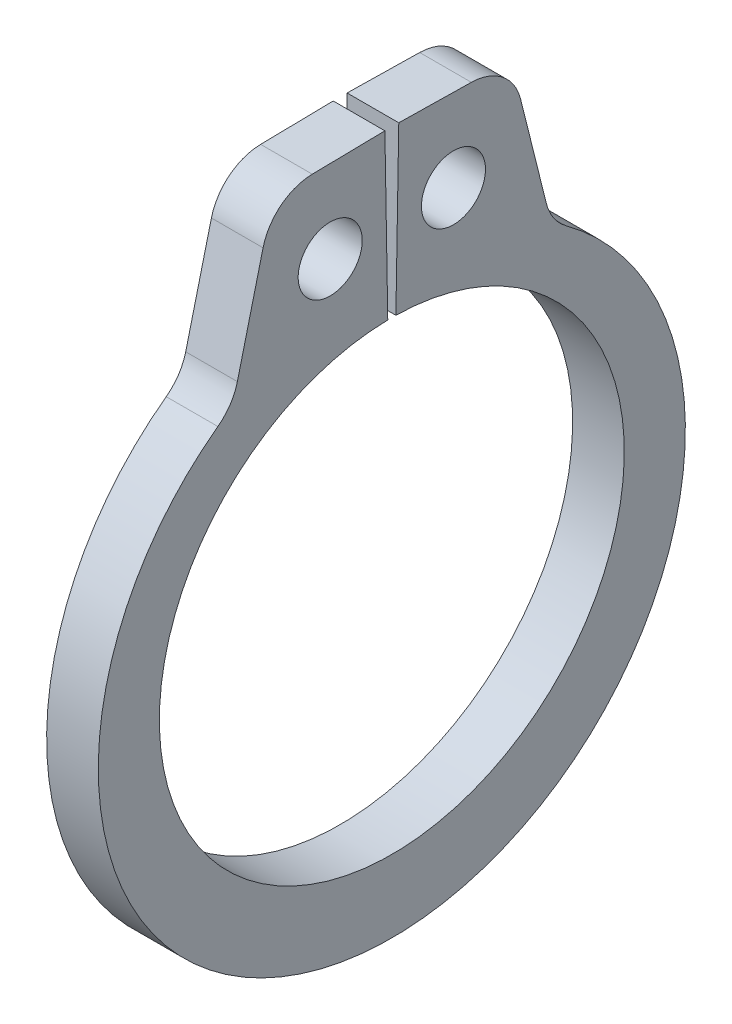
ISO-10303-21;
HEADER;
FILE_DESCRIPTION(('STEP AP214'),'2;1');
FILE_NAME('part.step','',(''),(''),'','','');
FILE_SCHEMA(('AUTOMOTIVE_DESIGN { 1 0 10303 214 1 1 1 1 }'));
ENDSEC;
DATA;
#1=APPLICATION_CONTEXT('core data for automotive mechanical design processes');
#2=APPLICATION_PROTOCOL_DEFINITION('international standard','automotive_design',2000,#1);
#3=PRODUCT_CONTEXT('',#1,'mechanical');
#4=PRODUCT('Part','Part','',(#3));
#5=PRODUCT_RELATED_PRODUCT_CATEGORY('part','',(#4));
#6=PRODUCT_DEFINITION_FORMATION('','',#4);
#7=PRODUCT_DEFINITION_CONTEXT('part definition',#1,'design');
#8=PRODUCT_DEFINITION('design','',#6,#7);
#9=PRODUCT_DEFINITION_SHAPE('','',#8);
#10=(LENGTH_UNIT() NAMED_UNIT(*) SI_UNIT(.MILLI.,.METRE.));
#11=(NAMED_UNIT(*) PLANE_ANGLE_UNIT() SI_UNIT($,.RADIAN.));
#12=(NAMED_UNIT(*) SI_UNIT($,.STERADIAN.) SOLID_ANGLE_UNIT());
#13=UNCERTAINTY_MEASURE_WITH_UNIT(LENGTH_MEASURE(1.E-05),#10,'distance_accuracy_value','');
#14=(GEOMETRIC_REPRESENTATION_CONTEXT(3) GLOBAL_UNCERTAINTY_ASSIGNED_CONTEXT((#13)) GLOBAL_UNIT_ASSIGNED_CONTEXT((#10,
#11,#12)) REPRESENTATION_CONTEXT('',''));
#15=CARTESIAN_POINT('',(0.,0.,0.));
#16=DIRECTION('',(0.,0.,1.));
#17=DIRECTION('',(1.,0.,0.));
#18=AXIS2_PLACEMENT_3D('',#15,#16,#17);
#19=CARTESIAN_POINT('',(0.3175,0.,0.));
#20=DIRECTION('',(1.,0.,0.));
#21=DIRECTION('',(0.,0.,-1.));
#22=AXIS2_PLACEMENT_3D('',#19,#20,#21);
#23=PLANE('',#22);
#24=CARTESIAN_POINT('',(0.3175,3.860869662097,0.757395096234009));
#25=DIRECTION('',(1.,0.,0.));
#26=DIRECTION('',(0.,0.,-1.));
#27=AXIS2_PLACEMENT_3D('',#24,#25,#26);
#28=CIRCLE('',#27,0.3937);
#29=CARTESIAN_POINT('',(0.3175,3.860869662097,0.363695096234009));
#30=VERTEX_POINT('',#29);
#31=EDGE_CURVE('E221',#30,#30,#28,.T.);
#32=ORIENTED_EDGE('',*,*,#31,.F.);
#33=EDGE_LOOP('',(#32));
#34=FACE_BOUND('',#33,.T.);
#35=DIRECTION('',(0.,0.970295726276,0.241921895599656));
#36=VECTOR('',#35,1.);
#37=CARTESIAN_POINT('',(0.3175,4.86467453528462,-1.46491994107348));
#38=LINE('',#37,#36);
#39=CARTESIAN_POINT('',(0.3175,3.12546492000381,-1.89855360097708));
#40=VERTEX_POINT('',#39);
#41=CARTESIAN_POINT('',(0.3175,4.39189538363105,-1.58279702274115));
#42=VERTEX_POINT('',#41);
#43=EDGE_CURVE('E204',#40,#42,#38,.T.);
#44=ORIENTED_EDGE('',*,*,#43,.T.);
#45=CARTESIAN_POINT('',(0.3175,4.23827497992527,-0.966659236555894));
#46=DIRECTION('',(1.,0.,0.));
#47=DIRECTION('',(0.,0.,-1.));
#48=AXIS2_PLACEMENT_3D('',#45,#46,#47);
#49=CIRCLE('',#48,0.635);
#50=CARTESIAN_POINT('',(0.3175,4.87317826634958,-0.977741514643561));
#51=VERTEX_POINT('',#50);
#52=EDGE_CURVE('E172',#42,#51,#49,.T.);
#53=ORIENTED_EDGE('',*,*,#52,.T.);
#54=DIRECTION('',(0.,0.0174524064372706,0.999847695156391));
#55=VECTOR('',#54,1.);
#56=CARTESIAN_POINT('',(0.3175,4.88875530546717,-0.0853335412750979));
#57=LINE('',#56,#55);
#58=CARTESIAN_POINT('',(0.3175,4.88875530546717,-0.0853335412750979));
#59=VERTEX_POINT('',#58);
#60=EDGE_CURVE('E210',#51,#59,#57,.T.);
#61=ORIENTED_EDGE('',*,*,#60,.T.);
#62=DIRECTION('',(0.,-0.999847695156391,0.0174524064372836));
#63=VECTOR('',#62,1.);
#64=CARTESIAN_POINT('',(0.3175,4.88875530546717,-0.0853335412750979));
#65=LINE('',#64,#63);
#66=CARTESIAN_POINT('',(0.3175,2.85706478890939,-0.0498702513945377));
#67=VERTEX_POINT('',#66);
#68=EDGE_CURVE('E144',#59,#67,#65,.T.);
#69=ORIENTED_EDGE('',*,*,#68,.T.);
#70=CARTESIAN_POINT('',(0.3175,0.,0.));
#71=DIRECTION('',(-1.,0.,0.));
#72=DIRECTION('',(0.,0.,-1.));
#73=AXIS2_PLACEMENT_3D('',#70,#71,#72);
#74=CIRCLE('',#73,2.8575);
#75=CARTESIAN_POINT('',(0.3175,2.85706478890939,0.0498702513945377));
#76=VERTEX_POINT('',#75);
#77=EDGE_CURVE('E138',#67,#76,#74,.T.);
#78=ORIENTED_EDGE('',*,*,#77,.T.);
#79=DIRECTION('',(0.,0.999847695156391,0.0174524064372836));
#80=VECTOR('',#79,1.);
#81=CARTESIAN_POINT('',(0.3175,2.85706478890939,0.0498702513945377));
#82=LINE('',#81,#80);
#83=CARTESIAN_POINT('',(0.3175,4.88875530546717,0.0853335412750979));
#84=VERTEX_POINT('',#83);
#85=EDGE_CURVE('E127',#76,#84,#82,.T.);
#86=ORIENTED_EDGE('',*,*,#85,.T.);
#87=DIRECTION('',(0.,-0.0174524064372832,0.999847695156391));
#88=VECTOR('',#87,1.);
#89=CARTESIAN_POINT('',(0.3175,4.88875530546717,0.0853335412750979));
#90=LINE('',#89,#88);
#91=CARTESIAN_POINT('',(0.3175,4.87317826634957,0.977741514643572));
#92=VERTEX_POINT('',#91);
#93=EDGE_CURVE('E137',#84,#92,#90,.T.);
#94=ORIENTED_EDGE('',*,*,#93,.T.);
#95=CARTESIAN_POINT('',(0.3175,4.23827497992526,0.966659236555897));
#96=DIRECTION('',(1.,0.,0.));
#97=DIRECTION('',(0.,0.,-1.));
#98=AXIS2_PLACEMENT_3D('',#95,#96,#97);
#99=CIRCLE('',#98,0.635);
#100=CARTESIAN_POINT('',(0.3175,4.39189538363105,1.58279702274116));
#101=VERTEX_POINT('',#100);
#102=EDGE_CURVE('E170',#92,#101,#99,.T.);
#103=ORIENTED_EDGE('',*,*,#102,.T.);
#104=DIRECTION('',(0.,-0.970295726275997,0.241921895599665));
#105=VECTOR('',#104,1.);
#106=CARTESIAN_POINT('',(0.3175,4.86467453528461,1.46491994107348));
#107=LINE('',#106,#105);
#108=CARTESIAN_POINT('',(0.3175,3.12546492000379,1.8985536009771));
#109=VERTEX_POINT('',#108);
#110=EDGE_CURVE('E213',#101,#109,#107,.T.);
#111=ORIENTED_EDGE('',*,*,#110,.T.);
#112=CARTESIAN_POINT('',(0.3175,3.27908532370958,2.51469138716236));
#113=DIRECTION('',(1.,0.,0.));
#114=DIRECTION('',(0.,0.,-1.));
#115=AXIS2_PLACEMENT_3D('',#112,#113,#114);
#116=CIRCLE('',#115,0.635);
#117=CARTESIAN_POINT('',(0.3175,2.76762449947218,2.13835001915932));
#118=VERTEX_POINT('',#117);
#119=EDGE_CURVE('E59',#109,#118,#116,.F.);
#120=ORIENTED_EDGE('',*,*,#119,.T.);
#121=CARTESIAN_POINT('',(0.3175,-0.138466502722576,0.));
#122=DIRECTION('',(1.,0.,0.));
#123=DIRECTION('',(0.,0.,-1.));
#124=AXIS2_PLACEMENT_3D('',#121,#122,#123);
#125=CIRCLE('',#124,3.60803349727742);
#126=CARTESIAN_POINT('',(0.3175,2.76762449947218,-2.13835001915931));
#127=VERTEX_POINT('',#126);
#128=EDGE_CURVE('E206',#118,#127,#125,.T.);
#129=ORIENTED_EDGE('',*,*,#128,.T.);
#130=CARTESIAN_POINT('',(0.3175,3.27908532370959,-2.51469138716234));
#131=DIRECTION('',(1.,0.,0.));
#132=DIRECTION('',(0.,0.,-1.));
#133=AXIS2_PLACEMENT_3D('',#130,#131,#132);
#134=CIRCLE('',#133,0.635);
#135=EDGE_CURVE('E11',#127,#40,#134,.F.);
#136=ORIENTED_EDGE('',*,*,#135,.T.);
#137=EDGE_LOOP('',(#44,#53,#61,#69,#78,#86,#94,#103,#111,#120,#129,#136));
#138=FACE_BOUND('',#137,.T.);
#139=CARTESIAN_POINT('',(0.3175,3.860869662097,-0.757395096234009));
#140=DIRECTION('',(1.,0.,0.));
#141=DIRECTION('',(0.,0.,-1.));
#142=AXIS2_PLACEMENT_3D('',#139,#140,#141);
#143=CIRCLE('',#142,0.3937);
#144=CARTESIAN_POINT('',(0.3175,3.860869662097,-1.15109509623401));
#145=VERTEX_POINT('',#144);
#146=EDGE_CURVE('E249',#145,#145,#143,.T.);
#147=ORIENTED_EDGE('',*,*,#146,.F.);
#148=EDGE_LOOP('',(#147));
#149=FACE_BOUND('',#148,.T.);
#150=ADVANCED_FACE('F37',(#34,#138,#149),#23,.T.);
#151=CARTESIAN_POINT('',(-0.3175,0.,0.));
#152=DIRECTION('',(1.,0.,0.));
#153=DIRECTION('',(0.,0.,-1.));
#154=AXIS2_PLACEMENT_3D('',#151,#152,#153);
#155=PLANE('',#154);
#156=CARTESIAN_POINT('',(-0.3175,3.860869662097,0.757395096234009));
#157=DIRECTION('',(1.,0.,0.));
#158=DIRECTION('',(0.,0.,-1.));
#159=AXIS2_PLACEMENT_3D('',#156,#157,#158);
#160=CIRCLE('',#159,0.3937);
#161=CARTESIAN_POINT('',(-0.3175,3.860869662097,0.363695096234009));
#162=VERTEX_POINT('',#161);
#163=EDGE_CURVE('E246',#162,#162,#160,.T.);
#164=ORIENTED_EDGE('',*,*,#163,.T.);
#165=EDGE_LOOP('',(#164));
#166=FACE_BOUND('',#165,.T.);
#167=DIRECTION('',(0.,0.0174524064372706,0.999847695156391));
#168=VECTOR('',#167,1.);
#169=CARTESIAN_POINT('',(-0.3175,4.88875530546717,-0.0853335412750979));
#170=LINE('',#169,#168);
#171=CARTESIAN_POINT('',(-0.3175,4.87317826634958,-0.977741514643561));
#172=VERTEX_POINT('',#171);
#173=CARTESIAN_POINT('',(-0.3175,4.88875530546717,-0.0853335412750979));
#174=VERTEX_POINT('',#173);
#175=EDGE_CURVE('E229',#172,#174,#170,.T.);
#176=ORIENTED_EDGE('',*,*,#175,.F.);
#177=CARTESIAN_POINT('',(-0.3175,4.23827497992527,-0.966659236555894));
#178=DIRECTION('',(1.,0.,0.));
#179=DIRECTION('',(0.,0.,-1.));
#180=AXIS2_PLACEMENT_3D('',#177,#178,#179);
#181=CIRCLE('',#180,0.635);
#182=CARTESIAN_POINT('',(-0.3175,4.39189538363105,-1.58279702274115));
#183=VERTEX_POINT('',#182);
#184=EDGE_CURVE('E163',#172,#183,#181,.F.);
#185=ORIENTED_EDGE('',*,*,#184,.T.);
#186=DIRECTION('',(0.,0.970295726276,0.241921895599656));
#187=VECTOR('',#186,1.);
#188=CARTESIAN_POINT('',(-0.3175,4.86467453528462,-1.46491994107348));
#189=LINE('',#188,#187);
#190=CARTESIAN_POINT('',(-0.3175,3.12546492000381,-1.89855360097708));
#191=VERTEX_POINT('',#190);
#192=EDGE_CURVE('E195',#191,#183,#189,.T.);
#193=ORIENTED_EDGE('',*,*,#192,.F.);
#194=CARTESIAN_POINT('',(-0.3175,3.27908532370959,-2.51469138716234));
#195=DIRECTION('',(1.,0.,0.));
#196=DIRECTION('',(0.,0.,-1.));
#197=AXIS2_PLACEMENT_3D('',#194,#195,#196);
#198=CIRCLE('',#197,0.635);
#199=CARTESIAN_POINT('',(-0.3175,2.76762449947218,-2.13835001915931));
#200=VERTEX_POINT('',#199);
#201=EDGE_CURVE('E45',#191,#200,#198,.T.);
#202=ORIENTED_EDGE('',*,*,#201,.T.);
#203=CARTESIAN_POINT('',(-0.3175,-0.138466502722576,0.));
#204=DIRECTION('',(1.,0.,0.));
#205=DIRECTION('',(0.,0.,-1.));
#206=AXIS2_PLACEMENT_3D('',#203,#204,#205);
#207=CIRCLE('',#206,3.60803349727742);
#208=CARTESIAN_POINT('',(-0.3175,2.76762449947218,2.13835001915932));
#209=VERTEX_POINT('',#208);
#210=EDGE_CURVE('E193',#209,#200,#207,.T.);
#211=ORIENTED_EDGE('',*,*,#210,.F.);
#212=CARTESIAN_POINT('',(-0.3175,3.27908532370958,2.51469138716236));
#213=DIRECTION('',(1.,0.,0.));
#214=DIRECTION('',(0.,0.,-1.));
#215=AXIS2_PLACEMENT_3D('',#212,#213,#214);
#216=CIRCLE('',#215,0.635);
#217=CARTESIAN_POINT('',(-0.3175,3.12546492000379,1.8985536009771));
#218=VERTEX_POINT('',#217);
#219=EDGE_CURVE('E185',#209,#218,#216,.T.);
#220=ORIENTED_EDGE('',*,*,#219,.T.);
#221=DIRECTION('',(0.,-0.970295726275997,0.241921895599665));
#222=VECTOR('',#221,1.);
#223=CARTESIAN_POINT('',(-0.3175,4.86467453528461,1.46491994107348));
#224=LINE('',#223,#222);
#225=CARTESIAN_POINT('',(-0.3175,4.39189538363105,1.58279702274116));
#226=VERTEX_POINT('',#225);
#227=EDGE_CURVE('E200',#226,#218,#224,.T.);
#228=ORIENTED_EDGE('',*,*,#227,.F.);
#229=CARTESIAN_POINT('',(-0.3175,4.23827497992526,0.966659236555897));
#230=DIRECTION('',(1.,0.,0.));
#231=DIRECTION('',(0.,0.,-1.));
#232=AXIS2_PLACEMENT_3D('',#229,#230,#231);
#233=CIRCLE('',#232,0.635);
#234=CARTESIAN_POINT('',(-0.3175,4.87317826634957,0.977741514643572));
#235=VERTEX_POINT('',#234);
#236=EDGE_CURVE('E156',#226,#235,#233,.F.);
#237=ORIENTED_EDGE('',*,*,#236,.T.);
#238=DIRECTION('',(0.,-0.0174524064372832,0.999847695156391));
#239=VECTOR('',#238,1.);
#240=CARTESIAN_POINT('',(-0.3175,4.88875530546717,0.0853335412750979));
#241=LINE('',#240,#239);
#242=CARTESIAN_POINT('',(-0.3175,4.88875530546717,0.0853335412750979));
#243=VERTEX_POINT('',#242);
#244=EDGE_CURVE('E223',#243,#235,#241,.T.);
#245=ORIENTED_EDGE('',*,*,#244,.F.);
#246=DIRECTION('',(0.,0.999847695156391,0.0174524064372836));
#247=VECTOR('',#246,1.);
#248=CARTESIAN_POINT('',(-0.3175,2.85706478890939,0.0498702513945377));
#249=LINE('',#248,#247);
#250=CARTESIAN_POINT('',(-0.3175,2.85706478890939,0.0498702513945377));
#251=VERTEX_POINT('',#250);
#252=EDGE_CURVE('E220',#251,#243,#249,.T.);
#253=ORIENTED_EDGE('',*,*,#252,.F.);
#254=CARTESIAN_POINT('',(-0.3175,0.,0.));
#255=DIRECTION('',(-1.,0.,0.));
#256=DIRECTION('',(0.,0.,-1.));
#257=AXIS2_PLACEMENT_3D('',#254,#255,#256);
#258=CIRCLE('',#257,2.8575);
#259=CARTESIAN_POINT('',(-0.3175,2.85706478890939,-0.0498702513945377));
#260=VERTEX_POINT('',#259);
#261=EDGE_CURVE('E152',#260,#251,#258,.T.);
#262=ORIENTED_EDGE('',*,*,#261,.F.);
#263=DIRECTION('',(0.,-0.999847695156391,0.0174524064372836));
#264=VECTOR('',#263,1.);
#265=CARTESIAN_POINT('',(-0.3175,4.88875530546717,-0.0853335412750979));
#266=LINE('',#265,#264);
#267=EDGE_CURVE('E148',#174,#260,#266,.T.);
#268=ORIENTED_EDGE('',*,*,#267,.F.);
#269=EDGE_LOOP('',(#176,#185,#193,#202,#211,#220,#228,#237,#245,#253,#262,#268));
#270=FACE_BOUND('',#269,.T.);
#271=CARTESIAN_POINT('',(-0.3175,3.860869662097,-0.757395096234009));
#272=DIRECTION('',(1.,0.,0.));
#273=DIRECTION('',(0.,0.,-1.));
#274=AXIS2_PLACEMENT_3D('',#271,#272,#273);
#275=CIRCLE('',#274,0.3937);
#276=CARTESIAN_POINT('',(-0.3175,3.860869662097,-1.15109509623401));
#277=VERTEX_POINT('',#276);
#278=EDGE_CURVE('E252',#277,#277,#275,.T.);
#279=ORIENTED_EDGE('',*,*,#278,.T.);
#280=EDGE_LOOP('',(#279));
#281=FACE_BOUND('',#280,.T.);
#282=ADVANCED_FACE('F191',(#166,#270,#281),#155,.F.);
#283=CARTESIAN_POINT('',(0.3175,0.,0.));
#284=DIRECTION('',(-1.,0.,0.));
#285=DIRECTION('',(0.,0.,1.));
#286=AXIS2_PLACEMENT_3D('',#283,#284,#285);
#287=CYLINDRICAL_SURFACE('',#286,2.8575);
#288=ORIENTED_EDGE('',*,*,#261,.T.);
#289=DIRECTION('',(-1.,0.,0.));
#290=VECTOR('',#289,1.);
#291=CARTESIAN_POINT('',(0.3175,2.85706478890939,0.0498702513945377));
#292=LINE('',#291,#290);
#293=EDGE_CURVE('E131',#76,#251,#292,.T.);
#294=ORIENTED_EDGE('',*,*,#293,.F.);
#295=ORIENTED_EDGE('',*,*,#77,.F.);
#296=DIRECTION('',(-1.,0.,0.));
#297=VECTOR('',#296,1.);
#298=CARTESIAN_POINT('',(0.3175,2.85706478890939,-0.0498702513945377));
#299=LINE('',#298,#297);
#300=EDGE_CURVE('E218',#67,#260,#299,.T.);
#301=ORIENTED_EDGE('',*,*,#300,.T.);
#302=EDGE_LOOP('',(#288,#294,#295,#301));
#303=FACE_BOUND('',#302,.T.);
#304=ADVANCED_FACE('F150',(#303),#287,.F.);
#305=CARTESIAN_POINT('',(0.3175,2.85706478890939,0.0498702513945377));
#306=DIRECTION('',(0.,-0.0174524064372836,0.999847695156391));
#307=DIRECTION('',(0.,-0.999847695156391,-0.0174524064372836));
#308=AXIS2_PLACEMENT_3D('',#305,#306,#307);
#309=PLANE('',#308);
#310=ORIENTED_EDGE('',*,*,#252,.T.);
#311=DIRECTION('',(-1.,0.,0.));
#312=VECTOR('',#311,1.);
#313=CARTESIAN_POINT('',(0.3175,4.88875530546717,0.0853335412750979));
#314=LINE('',#313,#312);
#315=EDGE_CURVE('E134',#84,#243,#314,.T.);
#316=ORIENTED_EDGE('',*,*,#315,.F.);
#317=ORIENTED_EDGE('',*,*,#85,.F.);
#318=ORIENTED_EDGE('',*,*,#293,.T.);
#319=EDGE_LOOP('',(#310,#316,#317,#318));
#320=FACE_BOUND('',#319,.T.);
#321=ADVANCED_FACE('F129',(#320),#309,.F.);
#322=CARTESIAN_POINT('',(0.3175,4.88875530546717,0.0853335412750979));
#323=DIRECTION('',(0.,-0.999847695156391,-0.0174524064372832));
#324=DIRECTION('',(0.,0.0174524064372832,-0.999847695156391));
#325=AXIS2_PLACEMENT_3D('',#322,#323,#324);
#326=PLANE('',#325);
#327=ORIENTED_EDGE('',*,*,#244,.T.);
#328=DIRECTION('',(-1.,0.,0.));
#329=VECTOR('',#328,1.);
#330=CARTESIAN_POINT('',(0.3175,4.87317826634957,0.977741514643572));
#331=LINE('',#330,#329);
#332=EDGE_CURVE('E179',#235,#92,#331,.F.);
#333=ORIENTED_EDGE('',*,*,#332,.T.);
#334=ORIENTED_EDGE('',*,*,#93,.F.);
#335=ORIENTED_EDGE('',*,*,#315,.T.);
#336=EDGE_LOOP('',(#327,#333,#334,#335));
#337=FACE_BOUND('',#336,.T.);
#338=ADVANCED_FACE('F241',(#337),#326,.F.);
#339=CARTESIAN_POINT('',(0.3175,4.86467453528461,1.46491994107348));
#340=DIRECTION('',(0.,-0.241921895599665,-0.970295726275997));
#341=DIRECTION('',(0.,0.970295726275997,-0.241921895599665));
#342=AXIS2_PLACEMENT_3D('',#339,#340,#341);
#343=PLANE('',#342);
#344=ORIENTED_EDGE('',*,*,#110,.F.);
#345=DIRECTION('',(-1.,0.,0.));
#346=VECTOR('',#345,1.);
#347=CARTESIAN_POINT('',(0.3175,4.39189538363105,1.58279702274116));
#348=LINE('',#347,#346);
#349=EDGE_CURVE('E176',#101,#226,#348,.T.);
#350=ORIENTED_EDGE('',*,*,#349,.T.);
#351=ORIENTED_EDGE('',*,*,#227,.T.);
#352=DIRECTION('',(1.,0.,0.));
#353=VECTOR('',#352,1.);
#354=CARTESIAN_POINT('',(0.3175,3.12546492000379,1.8985536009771));
#355=LINE('',#354,#353);
#356=EDGE_CURVE('E174',#218,#109,#355,.T.);
#357=ORIENTED_EDGE('',*,*,#356,.T.);
#358=EDGE_LOOP('',(#344,#350,#351,#357));
#359=FACE_BOUND('',#358,.T.);
#360=ADVANCED_FACE('F282',(#359),#343,.F.);
#361=CARTESIAN_POINT('',(0.3175,-0.138466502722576,0.));
#362=DIRECTION('',(-1.,0.,0.));
#363=DIRECTION('',(0.,0.,1.));
#364=AXIS2_PLACEMENT_3D('',#361,#362,#363);
#365=CYLINDRICAL_SURFACE('',#364,3.60803349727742);
#366=ORIENTED_EDGE('',*,*,#128,.F.);
#367=DIRECTION('',(-1.,0.,0.));
#368=VECTOR('',#367,1.);
#369=CARTESIAN_POINT('',(0.3175,2.76762449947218,2.13835001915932));
#370=LINE('',#369,#368);
#371=EDGE_CURVE('E182',#118,#209,#370,.T.);
#372=ORIENTED_EDGE('',*,*,#371,.T.);
#373=ORIENTED_EDGE('',*,*,#210,.T.);
#374=DIRECTION('',(-1.,0.,0.));
#375=VECTOR('',#374,1.);
#376=CARTESIAN_POINT('',(0.3175,2.76762449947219,-2.13835001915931));
#377=LINE('',#376,#375);
#378=EDGE_CURVE('E52',#200,#127,#377,.F.);
#379=ORIENTED_EDGE('',*,*,#378,.T.);
#380=EDGE_LOOP('',(#366,#372,#373,#379));
#381=FACE_BOUND('',#380,.T.);
#382=ADVANCED_FACE('F198',(#381),#365,.T.);
#383=CARTESIAN_POINT('',(0.3175,4.86467453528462,-1.46491994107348));
#384=DIRECTION('',(0.,-0.241921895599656,0.970295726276));
#385=DIRECTION('',(0.,-0.970295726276,-0.241921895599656));
#386=AXIS2_PLACEMENT_3D('',#383,#384,#385);
#387=PLANE('',#386);
#388=ORIENTED_EDGE('',*,*,#192,.T.);
#389=DIRECTION('',(-1.,0.,0.));
#390=VECTOR('',#389,1.);
#391=CARTESIAN_POINT('',(0.3175,4.39189538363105,-1.58279702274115));
#392=LINE('',#391,#390);
#393=EDGE_CURVE('E168',#183,#42,#392,.F.);
#394=ORIENTED_EDGE('',*,*,#393,.T.);
#395=ORIENTED_EDGE('',*,*,#43,.F.);
#396=DIRECTION('',(1.,0.,0.));
#397=VECTOR('',#396,1.);
#398=CARTESIAN_POINT('',(-0.3175,3.12546492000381,-1.89855360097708));
#399=LINE('',#398,#397);
#400=EDGE_CURVE('E165',#40,#191,#399,.F.);
#401=ORIENTED_EDGE('',*,*,#400,.T.);
#402=EDGE_LOOP('',(#388,#394,#395,#401));
#403=FACE_BOUND('',#402,.T.);
#404=ADVANCED_FACE('F208',(#403),#387,.F.);
#405=CARTESIAN_POINT('',(0.3175,4.88875530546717,-0.0853335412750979));
#406=DIRECTION('',(0.,-0.999847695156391,0.0174524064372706));
#407=DIRECTION('',(0.,-0.0174524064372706,-0.999847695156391));
#408=AXIS2_PLACEMENT_3D('',#405,#406,#407);
#409=PLANE('',#408);
#410=ORIENTED_EDGE('',*,*,#60,.F.);
#411=DIRECTION('',(-1.,0.,0.));
#412=VECTOR('',#411,1.);
#413=CARTESIAN_POINT('',(0.3175,4.87317826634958,-0.977741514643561));
#414=LINE('',#413,#412);
#415=EDGE_CURVE('E153',#51,#172,#414,.T.);
#416=ORIENTED_EDGE('',*,*,#415,.T.);
#417=ORIENTED_EDGE('',*,*,#175,.T.);
#418=DIRECTION('',(-1.,0.,0.));
#419=VECTOR('',#418,1.);
#420=CARTESIAN_POINT('',(0.3175,4.88875530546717,-0.0853335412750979));
#421=LINE('',#420,#419);
#422=EDGE_CURVE('E158',#59,#174,#421,.T.);
#423=ORIENTED_EDGE('',*,*,#422,.F.);
#424=EDGE_LOOP('',(#410,#416,#417,#423));
#425=FACE_BOUND('',#424,.T.);
#426=ADVANCED_FACE('F275',(#425),#409,.F.);
#427=CARTESIAN_POINT('',(0.3175,4.88875530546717,-0.0853335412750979));
#428=DIRECTION('',(0.,-0.0174524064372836,-0.999847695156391));
#429=DIRECTION('',(0.,0.999847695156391,-0.0174524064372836));
#430=AXIS2_PLACEMENT_3D('',#427,#428,#429);
#431=PLANE('',#430);
#432=ORIENTED_EDGE('',*,*,#267,.T.);
#433=ORIENTED_EDGE('',*,*,#300,.F.);
#434=ORIENTED_EDGE('',*,*,#68,.F.);
#435=ORIENTED_EDGE('',*,*,#422,.T.);
#436=EDGE_LOOP('',(#432,#433,#434,#435));
#437=FACE_BOUND('',#436,.T.);
#438=ADVANCED_FACE('F236',(#437),#431,.F.);
#439=CARTESIAN_POINT('',(0.3175,3.860869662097,0.757395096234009));
#440=DIRECTION('',(-1.,0.,0.));
#441=DIRECTION('',(0.,0.,1.));
#442=AXIS2_PLACEMENT_3D('',#439,#440,#441);
#443=CYLINDRICAL_SURFACE('',#442,0.3937);
#444=ORIENTED_EDGE('',*,*,#31,.T.);
#445=EDGE_LOOP('',(#444));
#446=FACE_BOUND('',#445,.T.);
#447=ORIENTED_EDGE('',*,*,#163,.F.);
#448=EDGE_LOOP('',(#447));
#449=FACE_BOUND('',#448,.T.);
#450=ADVANCED_FACE('F270',(#446,#449),#443,.F.);
#451=CARTESIAN_POINT('',(0.3175,3.860869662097,-0.757395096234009));
#452=DIRECTION('',(-1.,0.,0.));
#453=DIRECTION('',(0.,0.,1.));
#454=AXIS2_PLACEMENT_3D('',#451,#452,#453);
#455=CYLINDRICAL_SURFACE('',#454,0.3937);
#456=ORIENTED_EDGE('',*,*,#146,.T.);
#457=EDGE_LOOP('',(#456));
#458=FACE_BOUND('',#457,.T.);
#459=ORIENTED_EDGE('',*,*,#278,.F.);
#460=EDGE_LOOP('',(#459));
#461=FACE_BOUND('',#460,.T.);
#462=ADVANCED_FACE('F258',(#458,#461),#455,.F.);
#463=CARTESIAN_POINT('',(0.3175,4.23827497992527,-0.966659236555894));
#464=DIRECTION('',(-1.,0.,0.));
#465=DIRECTION('',(0.,0.,1.));
#466=AXIS2_PLACEMENT_3D('',#463,#464,#465);
#467=CYLINDRICAL_SURFACE('',#466,0.635);
#468=ORIENTED_EDGE('',*,*,#52,.F.);
#469=ORIENTED_EDGE('',*,*,#393,.F.);
#470=ORIENTED_EDGE('',*,*,#184,.F.);
#471=ORIENTED_EDGE('',*,*,#415,.F.);
#472=EDGE_LOOP('',(#468,#469,#470,#471));
#473=FACE_BOUND('',#472,.T.);
#474=ADVANCED_FACE('F292',(#473),#467,.T.);
#475=CARTESIAN_POINT('',(0.3175,4.23827497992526,0.966659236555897));
#476=DIRECTION('',(-1.,0.,0.));
#477=DIRECTION('',(0.,0.,1.));
#478=AXIS2_PLACEMENT_3D('',#475,#476,#477);
#479=CYLINDRICAL_SURFACE('',#478,0.635);
#480=ORIENTED_EDGE('',*,*,#102,.F.);
#481=ORIENTED_EDGE('',*,*,#332,.F.);
#482=ORIENTED_EDGE('',*,*,#236,.F.);
#483=ORIENTED_EDGE('',*,*,#349,.F.);
#484=EDGE_LOOP('',(#480,#481,#482,#483));
#485=FACE_BOUND('',#484,.T.);
#486=ADVANCED_FACE('F295',(#485),#479,.T.);
#487=CARTESIAN_POINT('',(0.3175,3.27908532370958,2.51469138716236));
#488=DIRECTION('',(-1.,0.,0.));
#489=DIRECTION('',(0.,0.,1.));
#490=AXIS2_PLACEMENT_3D('',#487,#488,#489);
#491=CYLINDRICAL_SURFACE('',#490,0.635);
#492=ORIENTED_EDGE('',*,*,#119,.F.);
#493=ORIENTED_EDGE('',*,*,#356,.F.);
#494=ORIENTED_EDGE('',*,*,#219,.F.);
#495=ORIENTED_EDGE('',*,*,#371,.F.);
#496=EDGE_LOOP('',(#492,#493,#494,#495));
#497=FACE_BOUND('',#496,.T.);
#498=ADVANCED_FACE('F298',(#497),#491,.F.);
#499=CARTESIAN_POINT('',(0.3175,3.27908532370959,-2.51469138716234));
#500=DIRECTION('',(-1.,0.,0.));
#501=DIRECTION('',(0.,0.,1.));
#502=AXIS2_PLACEMENT_3D('',#499,#500,#501);
#503=CYLINDRICAL_SURFACE('',#502,0.635);
#504=ORIENTED_EDGE('',*,*,#135,.F.);
#505=ORIENTED_EDGE('',*,*,#378,.F.);
#506=ORIENTED_EDGE('',*,*,#201,.F.);
#507=ORIENTED_EDGE('',*,*,#400,.F.);
#508=EDGE_LOOP('',(#504,#505,#506,#507));
#509=FACE_BOUND('',#508,.T.);
#510=ADVANCED_FACE('F39',(#509),#503,.F.);
#511=CLOSED_SHELL('',(#150,#282,#304,#321,#338,#360,#382,#404,#426,#438,#450,#462,#474,#486,
#498,#510));
#512=MANIFOLD_SOLID_BREP('B2',#511);
#513=ADVANCED_BREP_SHAPE_REPRESENTATION('',(#18,#512),#14);
#514=SHAPE_DEFINITION_REPRESENTATION(#9,#513);
ENDSEC;
END-ISO-10303-21;
